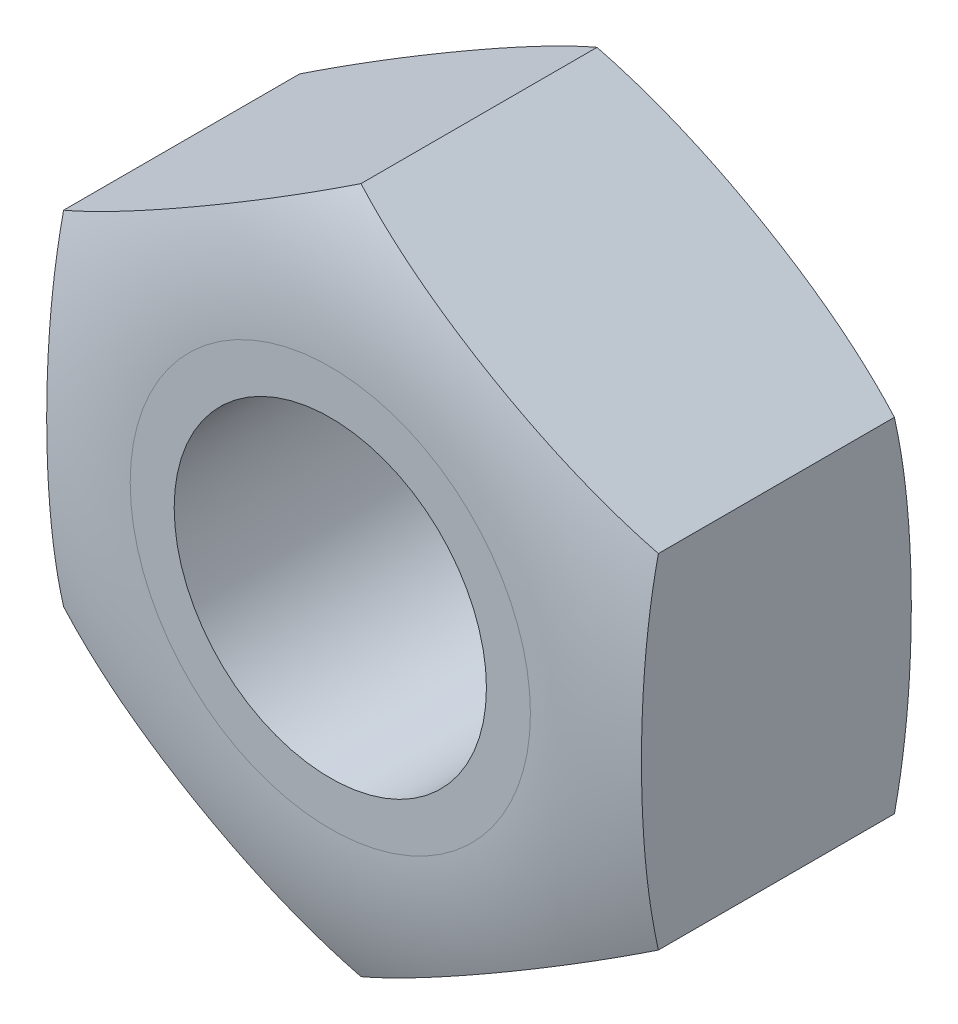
from build123d import *

# Parameters (mm, degrees)
AUFSATZ_LINEAR_AUSTRAGEN1_DEPTH = 4
M5_GEWINDEBOHRUNG1_D            = 4.2


with BuildPart() as part:
    # Skizze1 → Aufsatz-Linear austragen1 (new body)
    with BuildSketch(Plane.XY):
        Polygon((4, 2.309401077), (0, 4.618802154), (-4, 2.309401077), (-4, -2.309401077), (0, -4.618802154), (4, -2.309401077), align=None)
    extrude(amount=AUFSATZ_LINEAR_AUSTRAGEN1_DEPTH)

    # M5 Gewindebohrung1 (through all)
    with Locations(Plane.XY.offset(4)):
        with Locations((0, 0)):
            Hole(M5_GEWINDEBOHRUNG1_D / 2)

    # Skizze4 → Schnitt-Rotation1 (revolve, cut)
    with BuildSketch(Plane(origin=(0, 0, 0), x_dir=(1, 0, 0), z_dir=(0, 1, 0))):
        with BuildLine():
            Line((-4.7, -3.55), (-4.7, -4))
            Line((-4.7, -4), (-2.691547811, -4))
            ThreePointArc((-2.691547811, -4), (-3.720671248, -3.886122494), (-4.7, -3.55))
        make_face()
        with BuildLine():
            Line((-4.7, 0), (-2.691547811, 0))
            ThreePointArc((-2.691547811, 0), (-3.720671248, -0.113877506), (-4.7, -0.45))
            Line((-4.7, -0.45), (-4.7, 0))
        make_face()
    revolve(axis=Axis((0, 0, 0.715875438), (0, 0, 1)), mode=Mode.SUBTRACT)


solid = part.part
